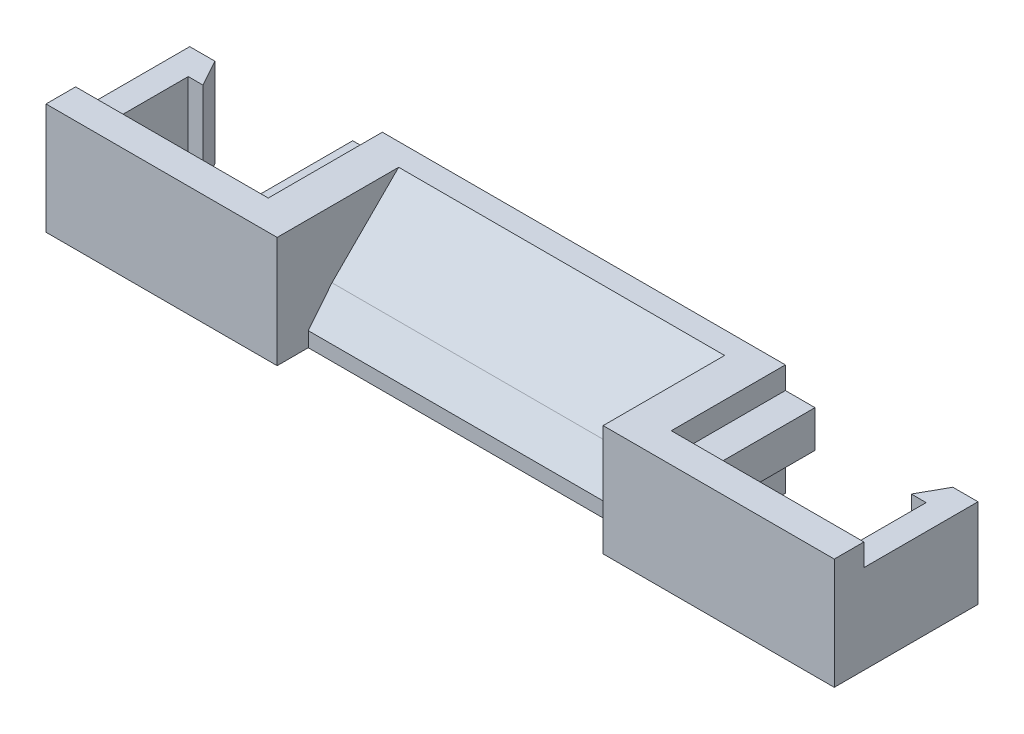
ISO-10303-21;
HEADER;
FILE_DESCRIPTION(('STEP AP214'),'2;1');
FILE_NAME('part.step','',(''),(''),'','','');
FILE_SCHEMA(('AUTOMOTIVE_DESIGN { 1 0 10303 214 1 1 1 1 }'));
ENDSEC;
DATA;
#1=APPLICATION_CONTEXT('core data for automotive mechanical design processes');
#2=APPLICATION_PROTOCOL_DEFINITION('international standard','automotive_design',2000,#1);
#3=PRODUCT_CONTEXT('',#1,'mechanical');
#4=PRODUCT('Part','Part','',(#3));
#5=PRODUCT_RELATED_PRODUCT_CATEGORY('part','',(#4));
#6=PRODUCT_DEFINITION_FORMATION('','',#4);
#7=PRODUCT_DEFINITION_CONTEXT('part definition',#1,'design');
#8=PRODUCT_DEFINITION('design','',#6,#7);
#9=PRODUCT_DEFINITION_SHAPE('','',#8);
#10=(LENGTH_UNIT() NAMED_UNIT(*) SI_UNIT(.MILLI.,.METRE.));
#11=(NAMED_UNIT(*) PLANE_ANGLE_UNIT() SI_UNIT($,.RADIAN.));
#12=(NAMED_UNIT(*) SI_UNIT($,.STERADIAN.) SOLID_ANGLE_UNIT());
#13=UNCERTAINTY_MEASURE_WITH_UNIT(LENGTH_MEASURE(1.E-05),#10,'distance_accuracy_value','');
#14=(GEOMETRIC_REPRESENTATION_CONTEXT(3) GLOBAL_UNCERTAINTY_ASSIGNED_CONTEXT((#13)) GLOBAL_UNIT_ASSIGNED_CONTEXT((#10,
#11,#12)) REPRESENTATION_CONTEXT('',''));
#15=CARTESIAN_POINT('',(0.,0.,0.));
#16=DIRECTION('',(0.,0.,1.));
#17=DIRECTION('',(1.,0.,0.));
#18=AXIS2_PLACEMENT_3D('',#15,#16,#17);
#19=CARTESIAN_POINT('',(-13.,0.,7.7));
#20=DIRECTION('',(0.,0.,1.));
#21=DIRECTION('',(1.,0.,0.));
#22=AXIS2_PLACEMENT_3D('',#19,#20,#21);
#23=PLANE('',#22);
#24=DIRECTION('',(0.,-1.,0.));
#25=VECTOR('',#24,1.);
#26=CARTESIAN_POINT('',(-11.3,6.,7.7));
#27=LINE('',#26,#25);
#28=CARTESIAN_POINT('',(-11.3,6.,7.7));
#29=VERTEX_POINT('',#28);
#30=CARTESIAN_POINT('',(-11.3,0.,7.7));
#31=VERTEX_POINT('',#30);
#32=EDGE_CURVE('E290',#29,#31,#27,.T.);
#33=ORIENTED_EDGE('',*,*,#32,.F.);
#34=DIRECTION('',(1.,0.,0.));
#35=VECTOR('',#34,1.);
#36=CARTESIAN_POINT('',(-11.3,6.,7.7));
#37=LINE('',#36,#35);
#38=CARTESIAN_POINT('',(-13.,6.,7.7));
#39=VERTEX_POINT('',#38);
#40=EDGE_CURVE('E286',#39,#29,#37,.T.);
#41=ORIENTED_EDGE('',*,*,#40,.F.);
#42=DIRECTION('',(0.,-1.,0.));
#43=VECTOR('',#42,1.);
#44=CARTESIAN_POINT('',(-13.,0.,7.7));
#45=LINE('',#44,#43);
#46=CARTESIAN_POINT('',(-13.,7.5,7.7));
#47=VERTEX_POINT('',#46);
#48=EDGE_CURVE('E334',#47,#39,#45,.T.);
#49=ORIENTED_EDGE('',*,*,#48,.F.);
#50=DIRECTION('',(1.,0.,0.));
#51=VECTOR('',#50,1.);
#52=CARTESIAN_POINT('',(-13.,7.5,7.7));
#53=LINE('',#52,#51);
#54=CARTESIAN_POINT('',(0.,7.5,7.7));
#55=VERTEX_POINT('',#54);
#56=EDGE_CURVE('E343',#47,#55,#53,.T.);
#57=ORIENTED_EDGE('',*,*,#56,.T.);
#58=DIRECTION('',(0.,-1.,0.));
#59=VECTOR('',#58,1.);
#60=CARTESIAN_POINT('',(0.,0.,7.7));
#61=LINE('',#60,#59);
#62=CARTESIAN_POINT('',(0.,6.,7.7));
#63=VERTEX_POINT('',#62);
#64=EDGE_CURVE('E332',#55,#63,#61,.T.);
#65=ORIENTED_EDGE('',*,*,#64,.T.);
#66=DIRECTION('',(-1.,0.,0.));
#67=VECTOR('',#66,1.);
#68=CARTESIAN_POINT('',(-2.,6.,7.7));
#69=LINE('',#68,#67);
#70=CARTESIAN_POINT('',(-2.,6.,7.7));
#71=VERTEX_POINT('',#70);
#72=EDGE_CURVE('E349',#63,#71,#69,.T.);
#73=ORIENTED_EDGE('',*,*,#72,.T.);
#74=DIRECTION('',(0.,-1.,0.));
#75=VECTOR('',#74,1.);
#76=CARTESIAN_POINT('',(-2.,0.,7.7));
#77=LINE('',#76,#75);
#78=CARTESIAN_POINT('',(-2.,3.5,7.7));
#79=VERTEX_POINT('',#78);
#80=EDGE_CURVE('E11',#71,#79,#77,.T.);
#81=ORIENTED_EDGE('',*,*,#80,.T.);
#82=DIRECTION('',(1.,0.,0.));
#83=VECTOR('',#82,1.);
#84=CARTESIAN_POINT('',(-2.,3.5,7.7));
#85=LINE('',#84,#83);
#86=CARTESIAN_POINT('',(0.,3.5,7.7));
#87=VERTEX_POINT('',#86);
#88=EDGE_CURVE('E346',#79,#87,#85,.T.);
#89=ORIENTED_EDGE('',*,*,#88,.T.);
#90=CARTESIAN_POINT('',(0.,0.,7.7));
#91=VERTEX_POINT('',#90);
#92=EDGE_CURVE('E316',#87,#91,#61,.T.);
#93=ORIENTED_EDGE('',*,*,#92,.T.);
#94=DIRECTION('',(1.,0.,0.));
#95=VECTOR('',#94,1.);
#96=CARTESIAN_POINT('',(-13.,0.,7.7));
#97=LINE('',#96,#95);
#98=EDGE_CURVE('E56',#31,#91,#97,.T.);
#99=ORIENTED_EDGE('',*,*,#98,.F.);
#100=EDGE_LOOP('',(#33,#41,#49,#57,#65,#73,#81,#89,#93,#99));
#101=FACE_BOUND('',#100,.T.);
#102=ADVANCED_FACE('F33',(#101),#23,.F.);
#103=CARTESIAN_POINT('',(40.2,7.5,7.7));
#104=DIRECTION('',(0.,0.,1.));
#105=DIRECTION('',(0.,-1.,0.));
#106=AXIS2_PLACEMENT_3D('',#103,#104,#105);
#107=PLANE('',#106);
#108=DIRECTION('',(0.,1.,0.));
#109=VECTOR('',#108,1.);
#110=CARTESIAN_POINT('',(38.5,6.,7.7));
#111=LINE('',#110,#109);
#112=CARTESIAN_POINT('',(38.5,0.,7.7));
#113=VERTEX_POINT('',#112);
#114=CARTESIAN_POINT('',(38.5,6.,7.7));
#115=VERTEX_POINT('',#114);
#116=EDGE_CURVE('E309',#113,#115,#111,.T.);
#117=ORIENTED_EDGE('',*,*,#116,.F.);
#118=DIRECTION('',(-1.,0.,0.));
#119=VECTOR('',#118,1.);
#120=CARTESIAN_POINT('',(40.2,0.,7.7));
#121=LINE('',#120,#119);
#122=CARTESIAN_POINT('',(27.2,0.,7.7));
#123=VERTEX_POINT('',#122);
#124=EDGE_CURVE('E364',#113,#123,#121,.T.);
#125=ORIENTED_EDGE('',*,*,#124,.T.);
#126=DIRECTION('',(0.,1.,0.));
#127=VECTOR('',#126,1.);
#128=CARTESIAN_POINT('',(27.2,7.5,7.7));
#129=LINE('',#128,#127);
#130=CARTESIAN_POINT('',(27.2,3.5,7.7));
#131=VERTEX_POINT('',#130);
#132=EDGE_CURVE('E356',#123,#131,#129,.T.);
#133=ORIENTED_EDGE('',*,*,#132,.T.);
#134=DIRECTION('',(1.,0.,0.));
#135=VECTOR('',#134,1.);
#136=CARTESIAN_POINT('',(29.2,3.5,7.7));
#137=LINE('',#136,#135);
#138=CARTESIAN_POINT('',(29.2,3.5,7.7));
#139=VERTEX_POINT('',#138);
#140=EDGE_CURVE('E374',#131,#139,#137,.T.);
#141=ORIENTED_EDGE('',*,*,#140,.T.);
#142=DIRECTION('',(0.,-1.,0.));
#143=VECTOR('',#142,1.);
#144=CARTESIAN_POINT('',(29.2,0.,7.7));
#145=LINE('',#144,#143);
#146=CARTESIAN_POINT('',(29.2,6.,7.7));
#147=VERTEX_POINT('',#146);
#148=EDGE_CURVE('E41',#147,#139,#145,.T.);
#149=ORIENTED_EDGE('',*,*,#148,.F.);
#150=DIRECTION('',(-1.,0.,0.));
#151=VECTOR('',#150,1.);
#152=CARTESIAN_POINT('',(29.2,6.,7.7));
#153=LINE('',#152,#151);
#154=CARTESIAN_POINT('',(27.2,6.,7.7));
#155=VERTEX_POINT('',#154);
#156=EDGE_CURVE('E371',#147,#155,#153,.T.);
#157=ORIENTED_EDGE('',*,*,#156,.T.);
#158=CARTESIAN_POINT('',(27.2,7.5,7.7));
#159=VERTEX_POINT('',#158);
#160=EDGE_CURVE('E352',#155,#159,#129,.T.);
#161=ORIENTED_EDGE('',*,*,#160,.T.);
#162=DIRECTION('',(-1.,0.,0.));
#163=VECTOR('',#162,1.);
#164=CARTESIAN_POINT('',(40.2,7.5,7.7));
#165=LINE('',#164,#163);
#166=CARTESIAN_POINT('',(40.2,7.5,7.7));
#167=VERTEX_POINT('',#166);
#168=EDGE_CURVE('E368',#167,#159,#165,.T.);
#169=ORIENTED_EDGE('',*,*,#168,.F.);
#170=DIRECTION('',(0.,1.,0.));
#171=VECTOR('',#170,1.);
#172=CARTESIAN_POINT('',(40.2,7.5,7.7));
#173=LINE('',#172,#171);
#174=CARTESIAN_POINT('',(40.2,6.,7.7));
#175=VERTEX_POINT('',#174);
#176=EDGE_CURVE('E353',#175,#167,#173,.T.);
#177=ORIENTED_EDGE('',*,*,#176,.F.);
#178=DIRECTION('',(1.,0.,0.));
#179=VECTOR('',#178,1.);
#180=CARTESIAN_POINT('',(40.2,6.,7.7));
#181=LINE('',#180,#179);
#182=EDGE_CURVE('E48',#115,#175,#181,.T.);
#183=ORIENTED_EDGE('',*,*,#182,.F.);
#184=EDGE_LOOP('',(#117,#125,#133,#141,#149,#157,#161,#169,#177,#183));
#185=FACE_BOUND('',#184,.T.);
#186=ADVANCED_FACE('F492',(#185),#107,.F.);
#187=CARTESIAN_POINT('',(0.,0.,9.7));
#188=DIRECTION('',(1.,0.,0.));
#189=DIRECTION('',(0.,0.,-1.));
#190=AXIS2_PLACEMENT_3D('',#187,#188,#189);
#191=PLANE('',#190);
#192=ORIENTED_EDGE('',*,*,#92,.F.);
#193=DIRECTION('',(0.,0.,1.));
#194=VECTOR('',#193,1.);
#195=CARTESIAN_POINT('',(0.,3.5,9.7));
#196=LINE('',#195,#194);
#197=CARTESIAN_POINT('',(0.,3.5,0.));
#198=VERTEX_POINT('',#197);
#199=EDGE_CURVE('E381',#198,#87,#196,.T.);
#200=ORIENTED_EDGE('',*,*,#199,.F.);
#201=DIRECTION('',(0.,-1.,0.));
#202=VECTOR('',#201,1.);
#203=CARTESIAN_POINT('',(0.,0.,0.));
#204=LINE('',#203,#202);
#205=CARTESIAN_POINT('',(0.,0.,0.));
#206=VERTEX_POINT('',#205);
#207=EDGE_CURVE('E444',#198,#206,#204,.T.);
#208=ORIENTED_EDGE('',*,*,#207,.T.);
#209=DIRECTION('',(0.,0.,-1.));
#210=VECTOR('',#209,1.);
#211=CARTESIAN_POINT('',(0.,0.,9.7));
#212=LINE('',#211,#210);
#213=EDGE_CURVE('E472',#91,#206,#212,.T.);
#214=ORIENTED_EDGE('',*,*,#213,.F.);
#215=EDGE_LOOP('',(#192,#200,#208,#214));
#216=FACE_BOUND('',#215,.T.);
#217=ADVANCED_FACE('F35',(#216),#191,.F.);
#218=ORIENTED_EDGE('',*,*,#64,.F.);
#219=DIRECTION('',(0.,0.,-1.));
#220=VECTOR('',#219,1.);
#221=CARTESIAN_POINT('',(0.,7.5,9.7));
#222=LINE('',#221,#220);
#223=CARTESIAN_POINT('',(0.,7.5,0.));
#224=VERTEX_POINT('',#223);
#225=EDGE_CURVE('E453',#55,#224,#222,.T.);
#226=ORIENTED_EDGE('',*,*,#225,.T.);
#227=CARTESIAN_POINT('',(0.,6.,0.));
#228=VERTEX_POINT('',#227);
#229=EDGE_CURVE('E454',#224,#228,#204,.T.);
#230=ORIENTED_EDGE('',*,*,#229,.T.);
#231=DIRECTION('',(0.,0.,-1.));
#232=VECTOR('',#231,1.);
#233=CARTESIAN_POINT('',(0.,6.,0.));
#234=LINE('',#233,#232);
#235=EDGE_CURVE('E377',#63,#228,#234,.T.);
#236=ORIENTED_EDGE('',*,*,#235,.F.);
#237=EDGE_LOOP('',(#218,#226,#230,#236));
#238=FACE_BOUND('',#237,.T.);
#239=ADVANCED_FACE('F582',(#238),#191,.F.);
#240=CARTESIAN_POINT('',(-2.,6.,0.));
#241=DIRECTION('',(0.,-1.,0.));
#242=DIRECTION('',(0.,0.,-1.));
#243=AXIS2_PLACEMENT_3D('',#240,#241,#242);
#244=PLANE('',#243);
#245=ORIENTED_EDGE('',*,*,#72,.F.);
#246=ORIENTED_EDGE('',*,*,#235,.T.);
#247=DIRECTION('',(1.,0.,0.));
#248=VECTOR('',#247,1.);
#249=CARTESIAN_POINT('',(-2.,6.,0.));
#250=LINE('',#249,#248);
#251=CARTESIAN_POINT('',(-2.,6.,0.));
#252=VERTEX_POINT('',#251);
#253=EDGE_CURVE('E391',#252,#228,#250,.T.);
#254=ORIENTED_EDGE('',*,*,#253,.F.);
#255=DIRECTION('',(0.,0.,-1.));
#256=VECTOR('',#255,1.);
#257=CARTESIAN_POINT('',(-2.,6.,0.));
#258=LINE('',#257,#256);
#259=EDGE_CURVE('E378',#71,#252,#258,.T.);
#260=ORIENTED_EDGE('',*,*,#259,.F.);
#261=EDGE_LOOP('',(#245,#246,#254,#260));
#262=FACE_BOUND('',#261,.T.);
#263=ADVANCED_FACE('F578',(#262),#244,.F.);
#264=CARTESIAN_POINT('',(-2.,3.5,9.7));
#265=DIRECTION('',(0.,1.,0.));
#266=DIRECTION('',(0.,0.,1.));
#267=AXIS2_PLACEMENT_3D('',#264,#265,#266);
#268=PLANE('',#267);
#269=ORIENTED_EDGE('',*,*,#88,.F.);
#270=DIRECTION('',(0.,0.,1.));
#271=VECTOR('',#270,1.);
#272=CARTESIAN_POINT('',(-2.,3.5,9.7));
#273=LINE('',#272,#271);
#274=CARTESIAN_POINT('',(-2.,3.5,0.));
#275=VERTEX_POINT('',#274);
#276=EDGE_CURVE('E383',#275,#79,#273,.T.);
#277=ORIENTED_EDGE('',*,*,#276,.F.);
#278=DIRECTION('',(1.,0.,0.));
#279=VECTOR('',#278,1.);
#280=CARTESIAN_POINT('',(-2.,3.5,0.));
#281=LINE('',#280,#279);
#282=EDGE_CURVE('E385',#275,#198,#281,.T.);
#283=ORIENTED_EDGE('',*,*,#282,.T.);
#284=ORIENTED_EDGE('',*,*,#199,.T.);
#285=EDGE_LOOP('',(#269,#277,#283,#284));
#286=FACE_BOUND('',#285,.T.);
#287=ADVANCED_FACE('F574',(#286),#268,.F.);
#288=CARTESIAN_POINT('',(-2.,0.,0.));
#289=DIRECTION('',(1.,0.,0.));
#290=DIRECTION('',(0.,0.,-1.));
#291=AXIS2_PLACEMENT_3D('',#288,#289,#290);
#292=PLANE('',#291);
#293=ORIENTED_EDGE('',*,*,#80,.F.);
#294=ORIENTED_EDGE('',*,*,#259,.T.);
#295=DIRECTION('',(0.,-1.,0.));
#296=VECTOR('',#295,1.);
#297=CARTESIAN_POINT('',(-2.,3.5,0.));
#298=LINE('',#297,#296);
#299=EDGE_CURVE('E380',#252,#275,#298,.T.);
#300=ORIENTED_EDGE('',*,*,#299,.T.);
#301=ORIENTED_EDGE('',*,*,#276,.T.);
#302=EDGE_LOOP('',(#293,#294,#300,#301));
#303=FACE_BOUND('',#302,.T.);
#304=ADVANCED_FACE('F570',(#303),#292,.F.);
#305=CARTESIAN_POINT('',(27.2,7.5,9.7));
#306=DIRECTION('',(-1.,0.,0.));
#307=DIRECTION('',(0.,0.,1.));
#308=AXIS2_PLACEMENT_3D('',#305,#306,#307);
#309=PLANE('',#308);
#310=ORIENTED_EDGE('',*,*,#160,.F.);
#311=DIRECTION('',(0.,0.,1.));
#312=VECTOR('',#311,1.);
#313=CARTESIAN_POINT('',(27.2,6.,9.7));
#314=LINE('',#313,#312);
#315=CARTESIAN_POINT('',(27.2,6.,0.));
#316=VERTEX_POINT('',#315);
#317=EDGE_CURVE('E398',#316,#155,#314,.T.);
#318=ORIENTED_EDGE('',*,*,#317,.F.);
#319=DIRECTION('',(0.,1.,0.));
#320=VECTOR('',#319,1.);
#321=CARTESIAN_POINT('',(27.2,7.5,0.));
#322=LINE('',#321,#320);
#323=CARTESIAN_POINT('',(27.2,7.5,0.));
#324=VERTEX_POINT('',#323);
#325=EDGE_CURVE('E460',#316,#324,#322,.T.);
#326=ORIENTED_EDGE('',*,*,#325,.T.);
#327=DIRECTION('',(0.,0.,-1.));
#328=VECTOR('',#327,1.);
#329=CARTESIAN_POINT('',(27.2,7.5,9.7));
#330=LINE('',#329,#328);
#331=EDGE_CURVE('E468',#159,#324,#330,.T.);
#332=ORIENTED_EDGE('',*,*,#331,.F.);
#333=EDGE_LOOP('',(#310,#318,#326,#332));
#334=FACE_BOUND('',#333,.T.);
#335=ADVANCED_FACE('F573',(#334),#309,.F.);
#336=ORIENTED_EDGE('',*,*,#132,.F.);
#337=DIRECTION('',(0.,0.,-1.));
#338=VECTOR('',#337,1.);
#339=CARTESIAN_POINT('',(27.2,0.,9.7));
#340=LINE('',#339,#338);
#341=CARTESIAN_POINT('',(27.2,0.,0.));
#342=VERTEX_POINT('',#341);
#343=EDGE_CURVE('E470',#123,#342,#340,.T.);
#344=ORIENTED_EDGE('',*,*,#343,.T.);
#345=CARTESIAN_POINT('',(27.2,3.5,0.));
#346=VERTEX_POINT('',#345);
#347=EDGE_CURVE('E461',#342,#346,#322,.T.);
#348=ORIENTED_EDGE('',*,*,#347,.T.);
#349=DIRECTION('',(0.,0.,-1.));
#350=VECTOR('',#349,1.);
#351=CARTESIAN_POINT('',(27.2,3.5,9.7));
#352=LINE('',#351,#350);
#353=EDGE_CURVE('E394',#131,#346,#352,.T.);
#354=ORIENTED_EDGE('',*,*,#353,.F.);
#355=EDGE_LOOP('',(#336,#344,#348,#354));
#356=FACE_BOUND('',#355,.T.);
#357=ADVANCED_FACE('F497',(#356),#309,.F.);
#358=CARTESIAN_POINT('',(29.2,3.5,9.7));
#359=DIRECTION('',(0.,1.,0.));
#360=DIRECTION('',(0.,0.,1.));
#361=AXIS2_PLACEMENT_3D('',#358,#359,#360);
#362=PLANE('',#361);
#363=ORIENTED_EDGE('',*,*,#140,.F.);
#364=ORIENTED_EDGE('',*,*,#353,.T.);
#365=DIRECTION('',(-1.,0.,0.));
#366=VECTOR('',#365,1.);
#367=CARTESIAN_POINT('',(29.2,3.5,0.));
#368=LINE('',#367,#366);
#369=CARTESIAN_POINT('',(29.2,3.5,0.));
#370=VERTEX_POINT('',#369);
#371=EDGE_CURVE('E409',#370,#346,#368,.T.);
#372=ORIENTED_EDGE('',*,*,#371,.F.);
#373=DIRECTION('',(0.,0.,-1.));
#374=VECTOR('',#373,1.);
#375=CARTESIAN_POINT('',(29.2,3.5,9.7));
#376=LINE('',#375,#374);
#377=EDGE_CURVE('E395',#139,#370,#376,.T.);
#378=ORIENTED_EDGE('',*,*,#377,.F.);
#379=EDGE_LOOP('',(#363,#364,#372,#378));
#380=FACE_BOUND('',#379,.T.);
#381=ADVANCED_FACE('F488',(#380),#362,.F.);
#382=CARTESIAN_POINT('',(29.2,6.,9.7));
#383=DIRECTION('',(0.,-1.,0.));
#384=DIRECTION('',(0.,0.,-1.));
#385=AXIS2_PLACEMENT_3D('',#382,#383,#384);
#386=PLANE('',#385);
#387=ORIENTED_EDGE('',*,*,#156,.F.);
#388=DIRECTION('',(0.,0.,1.));
#389=VECTOR('',#388,1.);
#390=CARTESIAN_POINT('',(29.2,6.,9.7));
#391=LINE('',#390,#389);
#392=CARTESIAN_POINT('',(29.2,6.,0.));
#393=VERTEX_POINT('',#392);
#394=EDGE_CURVE('E400',#393,#147,#391,.T.);
#395=ORIENTED_EDGE('',*,*,#394,.F.);
#396=DIRECTION('',(-1.,0.,0.));
#397=VECTOR('',#396,1.);
#398=CARTESIAN_POINT('',(29.2,6.,0.));
#399=LINE('',#398,#397);
#400=EDGE_CURVE('E403',#393,#316,#399,.T.);
#401=ORIENTED_EDGE('',*,*,#400,.T.);
#402=ORIENTED_EDGE('',*,*,#317,.T.);
#403=EDGE_LOOP('',(#387,#395,#401,#402));
#404=FACE_BOUND('',#403,.T.);
#405=ADVANCED_FACE('F513',(#404),#386,.F.);
#406=CARTESIAN_POINT('',(29.2,0.,0.));
#407=DIRECTION('',(1.,0.,0.));
#408=DIRECTION('',(0.,0.,-1.));
#409=AXIS2_PLACEMENT_3D('',#406,#407,#408);
#410=PLANE('',#409);
#411=ORIENTED_EDGE('',*,*,#394,.T.);
#412=ORIENTED_EDGE('',*,*,#148,.T.);
#413=ORIENTED_EDGE('',*,*,#377,.T.);
#414=DIRECTION('',(0.,1.,0.));
#415=VECTOR('',#414,1.);
#416=CARTESIAN_POINT('',(29.2,6.,0.));
#417=LINE('',#416,#415);
#418=EDGE_CURVE('E397',#370,#393,#417,.T.);
#419=ORIENTED_EDGE('',*,*,#418,.T.);
#420=EDGE_LOOP('',(#411,#412,#413,#419));
#421=FACE_BOUND('',#420,.T.);
#422=ADVANCED_FACE('F483',(#421),#410,.T.);
#423=CARTESIAN_POINT('',(0.,0.,9.7));
#424=DIRECTION('',(0.,0.,-1.));
#425=DIRECTION('',(-1.,0.,0.));
#426=AXIS2_PLACEMENT_3D('',#423,#424,#425);
#427=PLANE('',#426);
#428=DIRECTION('',(-1.,0.,0.));
#429=VECTOR('',#428,1.);
#430=CARTESIAN_POINT('',(0.,7.5,9.7));
#431=LINE('',#430,#429);
#432=CARTESIAN_POINT('',(2.6,7.5,9.7));
#433=VERTEX_POINT('',#432);
#434=CARTESIAN_POINT('',(-13.,7.5,9.7));
#435=VERTEX_POINT('',#434);
#436=EDGE_CURVE('E448',#433,#435,#431,.T.);
#437=ORIENTED_EDGE('',*,*,#436,.T.);
#438=DIRECTION('',(0.,1.,0.));
#439=VECTOR('',#438,1.);
#440=CARTESIAN_POINT('',(-13.,7.5,9.7));
#441=LINE('',#440,#439);
#442=CARTESIAN_POINT('',(-13.,0.,9.7));
#443=VERTEX_POINT('',#442);
#444=EDGE_CURVE('E328',#443,#435,#441,.T.);
#445=ORIENTED_EDGE('',*,*,#444,.F.);
#446=DIRECTION('',(1.,0.,0.));
#447=VECTOR('',#446,1.);
#448=CARTESIAN_POINT('',(0.,0.,9.7));
#449=LINE('',#448,#447);
#450=CARTESIAN_POINT('',(2.6,0.,9.7));
#451=VERTEX_POINT('',#450);
#452=EDGE_CURVE('E445',#443,#451,#449,.T.);
#453=ORIENTED_EDGE('',*,*,#452,.T.);
#454=DIRECTION('',(0.,-1.,0.));
#455=VECTOR('',#454,1.);
#456=CARTESIAN_POINT('',(2.6,0.,9.7));
#457=LINE('',#456,#455);
#458=EDGE_CURVE('E474',#433,#451,#457,.T.);
#459=ORIENTED_EDGE('',*,*,#458,.F.);
#460=EDGE_LOOP('',(#437,#445,#453,#459));
#461=FACE_BOUND('',#460,.T.);
#462=ADVANCED_FACE('F586',(#461),#427,.F.);
#463=CARTESIAN_POINT('',(0.,0.,9.7));
#464=DIRECTION('',(0.,1.,0.));
#465=DIRECTION('',(0.,0.,1.));
#466=AXIS2_PLACEMENT_3D('',#463,#464,#465);
#467=PLANE('',#466);
#468=CARTESIAN_POINT('',(24.6,0.,9.7));
#469=VERTEX_POINT('',#468);
#470=CARTESIAN_POINT('',(40.2,0.,9.7));
#471=VERTEX_POINT('',#470);
#472=EDGE_CURVE('E449',#469,#471,#449,.T.);
#473=ORIENTED_EDGE('',*,*,#472,.F.);
#474=DIRECTION('',(0.,0.,-1.));
#475=VECTOR('',#474,1.);
#476=CARTESIAN_POINT('',(24.6,0.,9.7));
#477=LINE('',#476,#475);
#478=CARTESIAN_POINT('',(24.6,0.,7.6));
#479=VERTEX_POINT('',#478);
#480=EDGE_CURVE('E441',#469,#479,#477,.T.);
#481=ORIENTED_EDGE('',*,*,#480,.T.);
#482=DIRECTION('',(1.,0.,0.));
#483=VECTOR('',#482,1.);
#484=CARTESIAN_POINT('',(0.,0.,7.6));
#485=LINE('',#484,#483);
#486=CARTESIAN_POINT('',(2.6,0.,7.6));
#487=VERTEX_POINT('',#486);
#488=EDGE_CURVE('E479',#487,#479,#485,.T.);
#489=ORIENTED_EDGE('',*,*,#488,.F.);
#490=DIRECTION('',(0.,0.,-1.));
#491=VECTOR('',#490,1.);
#492=CARTESIAN_POINT('',(2.6,0.,9.7));
#493=LINE('',#492,#491);
#494=EDGE_CURVE('E436',#451,#487,#493,.T.);
#495=ORIENTED_EDGE('',*,*,#494,.F.);
#496=ORIENTED_EDGE('',*,*,#452,.F.);
#497=DIRECTION('',(0.,0.,1.));
#498=VECTOR('',#497,1.);
#499=CARTESIAN_POINT('',(-13.,0.,9.7));
#500=LINE('',#499,#498);
#501=CARTESIAN_POINT('',(-13.,0.,0.));
#502=VERTEX_POINT('',#501);
#503=EDGE_CURVE('E337',#502,#443,#500,.T.);
#504=ORIENTED_EDGE('',*,*,#503,.F.);
#505=DIRECTION('',(-1.,0.,0.));
#506=VECTOR('',#505,1.);
#507=CARTESIAN_POINT('',(-11.3,0.,0.));
#508=LINE('',#507,#506);
#509=CARTESIAN_POINT('',(-11.3,0.,0.));
#510=VERTEX_POINT('',#509);
#511=EDGE_CURVE('E298',#510,#502,#508,.T.);
#512=ORIENTED_EDGE('',*,*,#511,.F.);
#513=DIRECTION('',(0.485642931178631,0.,0.874157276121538));
#514=VECTOR('',#513,1.);
#515=CARTESIAN_POINT('',(-10.3,0.,1.80000000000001));
#516=LINE('',#515,#514);
#517=CARTESIAN_POINT('',(-10.3,0.,1.80000000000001));
#518=VERTEX_POINT('',#517);
#519=EDGE_CURVE('E270',#510,#518,#516,.T.);
#520=ORIENTED_EDGE('',*,*,#519,.T.);
#521=DIRECTION('',(-1.,0.,0.));
#522=VECTOR('',#521,1.);
#523=CARTESIAN_POINT('',(-11.3,0.,1.8));
#524=LINE('',#523,#522);
#525=CARTESIAN_POINT('',(-11.3,0.,1.8));
#526=VERTEX_POINT('',#525);
#527=EDGE_CURVE('E249',#518,#526,#524,.T.);
#528=ORIENTED_EDGE('',*,*,#527,.T.);
#529=DIRECTION('',(0.,0.,1.));
#530=VECTOR('',#529,1.);
#531=CARTESIAN_POINT('',(-11.3,0.,-6.23618473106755));
#532=LINE('',#531,#530);
#533=EDGE_CURVE('E293',#526,#31,#532,.T.);
#534=ORIENTED_EDGE('',*,*,#533,.T.);
#535=ORIENTED_EDGE('',*,*,#98,.T.);
#536=ORIENTED_EDGE('',*,*,#213,.T.);
#537=DIRECTION('',(1.,0.,0.));
#538=VECTOR('',#537,1.);
#539=CARTESIAN_POINT('',(0.,0.,0.));
#540=LINE('',#539,#538);
#541=EDGE_CURVE('E457',#206,#342,#540,.T.);
#542=ORIENTED_EDGE('',*,*,#541,.T.);
#543=ORIENTED_EDGE('',*,*,#343,.F.);
#544=ORIENTED_EDGE('',*,*,#124,.F.);
#545=DIRECTION('',(0.,0.,1.));
#546=VECTOR('',#545,1.);
#547=CARTESIAN_POINT('',(38.5,0.,-6.23618473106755));
#548=LINE('',#547,#546);
#549=CARTESIAN_POINT('',(38.5,0.,1.8));
#550=VERTEX_POINT('',#549);
#551=EDGE_CURVE('E312',#550,#113,#548,.T.);
#552=ORIENTED_EDGE('',*,*,#551,.F.);
#553=DIRECTION('',(-1.,0.,0.));
#554=VECTOR('',#553,1.);
#555=CARTESIAN_POINT('',(38.5,0.,1.8));
#556=LINE('',#555,#554);
#557=CARTESIAN_POINT('',(37.5,0.,1.8));
#558=VERTEX_POINT('',#557);
#559=EDGE_CURVE('E275',#550,#558,#556,.T.);
#560=ORIENTED_EDGE('',*,*,#559,.T.);
#561=DIRECTION('',(0.485642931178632,0.,-0.874157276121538));
#562=VECTOR('',#561,1.);
#563=CARTESIAN_POINT('',(37.5,0.,1.8));
#564=LINE('',#563,#562);
#565=CARTESIAN_POINT('',(38.5,0.,0.));
#566=VERTEX_POINT('',#565);
#567=EDGE_CURVE('E273',#558,#566,#564,.T.);
#568=ORIENTED_EDGE('',*,*,#567,.T.);
#569=DIRECTION('',(-1.,0.,0.));
#570=VECTOR('',#569,1.);
#571=CARTESIAN_POINT('',(40.2,0.,0.));
#572=LINE('',#571,#570);
#573=CARTESIAN_POINT('',(40.2,0.,0.));
#574=VERTEX_POINT('',#573);
#575=EDGE_CURVE('E317',#574,#566,#572,.T.);
#576=ORIENTED_EDGE('',*,*,#575,.F.);
#577=DIRECTION('',(0.,0.,-1.));
#578=VECTOR('',#577,1.);
#579=CARTESIAN_POINT('',(40.2,0.,7.7));
#580=LINE('',#579,#578);
#581=EDGE_CURVE('E362',#471,#574,#580,.T.);
#582=ORIENTED_EDGE('',*,*,#581,.F.);
#583=EDGE_LOOP('',(#473,#481,#489,#495,#496,#504,#512,#520,#528,#534,#535,#536,#542,#543,#544,
#552,#560,#568,#576,#582));
#584=FACE_BOUND('',#583,.T.);
#585=ADVANCED_FACE('F499',(#584),#467,.F.);
#586=CARTESIAN_POINT('',(0.,7.5,9.7));
#587=DIRECTION('',(0.,-1.,0.));
#588=DIRECTION('',(0.,0.,-1.));
#589=AXIS2_PLACEMENT_3D('',#586,#587,#588);
#590=PLANE('',#589);
#591=DIRECTION('',(-1.,0.,0.));
#592=VECTOR('',#591,1.);
#593=CARTESIAN_POINT('',(24.6,7.5,1.5));
#594=LINE('',#593,#592);
#595=CARTESIAN_POINT('',(24.6,7.5,1.5));
#596=VERTEX_POINT('',#595);
#597=CARTESIAN_POINT('',(2.6,7.5,1.5));
#598=VERTEX_POINT('',#597);
#599=EDGE_CURVE('E421',#596,#598,#594,.T.);
#600=ORIENTED_EDGE('',*,*,#599,.F.);
#601=DIRECTION('',(0.,0.,1.));
#602=VECTOR('',#601,1.);
#603=CARTESIAN_POINT('',(24.6,7.5,9.7));
#604=LINE('',#603,#602);
#605=CARTESIAN_POINT('',(24.6,7.5,9.7));
#606=VERTEX_POINT('',#605);
#607=EDGE_CURVE('E438',#596,#606,#604,.T.);
#608=ORIENTED_EDGE('',*,*,#607,.T.);
#609=CARTESIAN_POINT('',(40.2,7.5,9.7));
#610=VERTEX_POINT('',#609);
#611=EDGE_CURVE('E450',#610,#606,#431,.T.);
#612=ORIENTED_EDGE('',*,*,#611,.F.);
#613=DIRECTION('',(0.,0.,1.));
#614=VECTOR('',#613,1.);
#615=CARTESIAN_POINT('',(40.2,7.5,7.7));
#616=LINE('',#615,#614);
#617=EDGE_CURVE('E355',#167,#610,#616,.T.);
#618=ORIENTED_EDGE('',*,*,#617,.F.);
#619=ORIENTED_EDGE('',*,*,#168,.T.);
#620=ORIENTED_EDGE('',*,*,#331,.T.);
#621=DIRECTION('',(-1.,0.,0.));
#622=VECTOR('',#621,1.);
#623=CARTESIAN_POINT('',(0.,7.5,0.));
#624=LINE('',#623,#622);
#625=EDGE_CURVE('E464',#324,#224,#624,.T.);
#626=ORIENTED_EDGE('',*,*,#625,.T.);
#627=ORIENTED_EDGE('',*,*,#225,.F.);
#628=ORIENTED_EDGE('',*,*,#56,.F.);
#629=DIRECTION('',(0.,0.,-1.));
#630=VECTOR('',#629,1.);
#631=CARTESIAN_POINT('',(-13.,7.5,7.7));
#632=LINE('',#631,#630);
#633=EDGE_CURVE('E331',#435,#47,#632,.T.);
#634=ORIENTED_EDGE('',*,*,#633,.F.);
#635=ORIENTED_EDGE('',*,*,#436,.F.);
#636=DIRECTION('',(0.,0.,1.));
#637=VECTOR('',#636,1.);
#638=CARTESIAN_POINT('',(2.6,7.5,9.7));
#639=LINE('',#638,#637);
#640=EDGE_CURVE('E434',#598,#433,#639,.T.);
#641=ORIENTED_EDGE('',*,*,#640,.F.);
#642=EDGE_LOOP('',(#600,#608,#612,#618,#619,#620,#626,#627,#628,#634,#635,#641));
#643=FACE_BOUND('',#642,.T.);
#644=ADVANCED_FACE('F521',(#643),#590,.F.);
#645=ORIENTED_EDGE('',*,*,#472,.T.);
#646=DIRECTION('',(0.,-1.,0.));
#647=VECTOR('',#646,1.);
#648=CARTESIAN_POINT('',(40.2,7.5,9.7));
#649=LINE('',#648,#647);
#650=EDGE_CURVE('E359',#610,#471,#649,.T.);
#651=ORIENTED_EDGE('',*,*,#650,.F.);
#652=ORIENTED_EDGE('',*,*,#611,.T.);
#653=DIRECTION('',(0.,-1.,0.));
#654=VECTOR('',#653,1.);
#655=CARTESIAN_POINT('',(24.6,0.,9.7));
#656=LINE('',#655,#654);
#657=EDGE_CURVE('E476',#606,#469,#656,.T.);
#658=ORIENTED_EDGE('',*,*,#657,.T.);
#659=EDGE_LOOP('',(#645,#651,#652,#658));
#660=FACE_BOUND('',#659,.T.);
#661=ADVANCED_FACE('F527',(#660),#427,.F.);
#662=CARTESIAN_POINT('',(0.,0.,0.));
#663=DIRECTION('',(0.,0.,-1.));
#664=DIRECTION('',(-1.,0.,0.));
#665=AXIS2_PLACEMENT_3D('',#662,#663,#664);
#666=PLANE('',#665);
#667=ORIENTED_EDGE('',*,*,#229,.F.);
#668=ORIENTED_EDGE('',*,*,#625,.F.);
#669=ORIENTED_EDGE('',*,*,#325,.F.);
#670=ORIENTED_EDGE('',*,*,#400,.F.);
#671=ORIENTED_EDGE('',*,*,#418,.F.);
#672=ORIENTED_EDGE('',*,*,#371,.T.);
#673=ORIENTED_EDGE('',*,*,#347,.F.);
#674=ORIENTED_EDGE('',*,*,#541,.F.);
#675=ORIENTED_EDGE('',*,*,#207,.F.);
#676=ORIENTED_EDGE('',*,*,#282,.F.);
#677=ORIENTED_EDGE('',*,*,#299,.F.);
#678=ORIENTED_EDGE('',*,*,#253,.T.);
#679=EDGE_LOOP('',(#667,#668,#669,#670,#671,#672,#673,#674,#675,#676,#677,#678));
#680=FACE_BOUND('',#679,.T.);
#681=ADVANCED_FACE('F507',(#680),#666,.T.);
#682=CARTESIAN_POINT('',(24.6,0.,7.6));
#683=DIRECTION('',(0.,0.,1.));
#684=DIRECTION('',(1.,0.,0.));
#685=AXIS2_PLACEMENT_3D('',#682,#683,#684);
#686=PLANE('',#685);
#687=ORIENTED_EDGE('',*,*,#488,.T.);
#688=DIRECTION('',(0.,1.,0.));
#689=VECTOR('',#688,1.);
#690=CARTESIAN_POINT('',(24.6,-0.801733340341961,7.6));
#691=LINE('',#690,#689);
#692=CARTESIAN_POINT('',(24.6,1.,7.6));
#693=VERTEX_POINT('',#692);
#694=EDGE_CURVE('E413',#479,#693,#691,.T.);
#695=ORIENTED_EDGE('',*,*,#694,.T.);
#696=DIRECTION('',(-1.,0.,0.));
#697=VECTOR('',#696,1.);
#698=CARTESIAN_POINT('',(24.6,1.,7.6));
#699=LINE('',#698,#697);
#700=CARTESIAN_POINT('',(2.6,1.,7.6));
#701=VERTEX_POINT('',#700);
#702=EDGE_CURVE('E431',#693,#701,#699,.T.);
#703=ORIENTED_EDGE('',*,*,#702,.T.);
#704=DIRECTION('',(0.,1.,0.));
#705=VECTOR('',#704,1.);
#706=CARTESIAN_POINT('',(2.6,0.,7.6));
#707=LINE('',#706,#705);
#708=EDGE_CURVE('E412',#487,#701,#707,.T.);
#709=ORIENTED_EDGE('',*,*,#708,.F.);
#710=EDGE_LOOP('',(#687,#695,#703,#709));
#711=FACE_BOUND('',#710,.T.);
#712=ADVANCED_FACE('F595',(#711),#686,.T.);
#713=CARTESIAN_POINT('',(24.6,0.,0.));
#714=DIRECTION('',(1.,0.,0.));
#715=DIRECTION('',(0.,0.,-1.));
#716=AXIS2_PLACEMENT_3D('',#713,#714,#715);
#717=PLANE('',#716);
#718=ORIENTED_EDGE('',*,*,#657,.F.);
#719=ORIENTED_EDGE('',*,*,#607,.F.);
#720=DIRECTION('',(0.,0.707106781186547,-0.707106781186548));
#721=VECTOR('',#720,1.);
#722=CARTESIAN_POINT('',(24.6,3.,6.));
#723=LINE('',#722,#721);
#724=CARTESIAN_POINT('',(24.6,3.,6.));
#725=VERTEX_POINT('',#724);
#726=EDGE_CURVE('E418',#725,#596,#723,.T.);
#727=ORIENTED_EDGE('',*,*,#726,.F.);
#728=DIRECTION('',(0.,0.78086880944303,-0.624695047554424));
#729=VECTOR('',#728,1.);
#730=CARTESIAN_POINT('',(24.6,1.,7.6));
#731=LINE('',#730,#729);
#732=EDGE_CURVE('E415',#693,#725,#731,.T.);
#733=ORIENTED_EDGE('',*,*,#732,.F.);
#734=ORIENTED_EDGE('',*,*,#694,.F.);
#735=ORIENTED_EDGE('',*,*,#480,.F.);
#736=EDGE_LOOP('',(#718,#719,#727,#733,#734,#735));
#737=FACE_BOUND('',#736,.T.);
#738=ADVANCED_FACE('F591',(#737),#717,.F.);
#739=CARTESIAN_POINT('',(2.6,0.,0.));
#740=DIRECTION('',(1.,0.,0.));
#741=DIRECTION('',(0.,0.,-1.));
#742=AXIS2_PLACEMENT_3D('',#739,#740,#741);
#743=PLANE('',#742);
#744=ORIENTED_EDGE('',*,*,#494,.T.);
#745=ORIENTED_EDGE('',*,*,#708,.T.);
#746=DIRECTION('',(0.,0.78086880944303,-0.624695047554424));
#747=VECTOR('',#746,1.);
#748=CARTESIAN_POINT('',(2.6,1.,7.6));
#749=LINE('',#748,#747);
#750=CARTESIAN_POINT('',(2.6,3.,6.));
#751=VERTEX_POINT('',#750);
#752=EDGE_CURVE('E423',#701,#751,#749,.T.);
#753=ORIENTED_EDGE('',*,*,#752,.T.);
#754=DIRECTION('',(0.,0.707106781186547,-0.707106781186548));
#755=VECTOR('',#754,1.);
#756=CARTESIAN_POINT('',(2.6,3.,6.));
#757=LINE('',#756,#755);
#758=EDGE_CURVE('E416',#751,#598,#757,.T.);
#759=ORIENTED_EDGE('',*,*,#758,.T.);
#760=ORIENTED_EDGE('',*,*,#640,.T.);
#761=ORIENTED_EDGE('',*,*,#458,.T.);
#762=EDGE_LOOP('',(#744,#745,#753,#759,#760,#761));
#763=FACE_BOUND('',#762,.T.);
#764=ADVANCED_FACE('F594',(#763),#743,.T.);
#765=CARTESIAN_POINT('',(24.6,1.,7.6));
#766=DIRECTION('',(0.,0.624695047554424,0.78086880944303));
#767=DIRECTION('',(0.,-0.78086880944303,0.624695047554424));
#768=AXIS2_PLACEMENT_3D('',#765,#766,#767);
#769=PLANE('',#768);
#770=ORIENTED_EDGE('',*,*,#752,.F.);
#771=ORIENTED_EDGE('',*,*,#702,.F.);
#772=ORIENTED_EDGE('',*,*,#732,.T.);
#773=DIRECTION('',(-1.,0.,0.));
#774=VECTOR('',#773,1.);
#775=CARTESIAN_POINT('',(24.6,3.,6.));
#776=LINE('',#775,#774);
#777=EDGE_CURVE('E428',#725,#751,#776,.T.);
#778=ORIENTED_EDGE('',*,*,#777,.T.);
#779=EDGE_LOOP('',(#770,#771,#772,#778));
#780=FACE_BOUND('',#779,.T.);
#781=ADVANCED_FACE('F599',(#780),#769,.T.);
#782=CARTESIAN_POINT('',(24.6,3.,6.));
#783=DIRECTION('',(0.,0.707106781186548,0.707106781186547));
#784=DIRECTION('',(0.,-0.707106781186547,0.707106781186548));
#785=AXIS2_PLACEMENT_3D('',#782,#783,#784);
#786=PLANE('',#785);
#787=ORIENTED_EDGE('',*,*,#758,.F.);
#788=ORIENTED_EDGE('',*,*,#777,.F.);
#789=ORIENTED_EDGE('',*,*,#726,.T.);
#790=ORIENTED_EDGE('',*,*,#599,.T.);
#791=EDGE_LOOP('',(#787,#788,#789,#790));
#792=FACE_BOUND('',#791,.T.);
#793=ADVANCED_FACE('F568',(#792),#786,.T.);
#794=CARTESIAN_POINT('',(40.2,0.,0.));
#795=DIRECTION('',(-1.,0.,0.));
#796=DIRECTION('',(0.,0.,1.));
#797=AXIS2_PLACEMENT_3D('',#794,#795,#796);
#798=PLANE('',#797);
#799=ORIENTED_EDGE('',*,*,#581,.T.);
#800=DIRECTION('',(0.,-1.,0.));
#801=VECTOR('',#800,1.);
#802=CARTESIAN_POINT('',(40.2,6.,0.));
#803=LINE('',#802,#801);
#804=CARTESIAN_POINT('',(40.2,6.,0.));
#805=VERTEX_POINT('',#804);
#806=EDGE_CURVE('E320',#805,#574,#803,.T.);
#807=ORIENTED_EDGE('',*,*,#806,.F.);
#808=DIRECTION('',(0.,0.,1.));
#809=VECTOR('',#808,1.);
#810=CARTESIAN_POINT('',(40.2,6.,-6.23618473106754));
#811=LINE('',#810,#809);
#812=EDGE_CURVE('E297',#805,#175,#811,.T.);
#813=ORIENTED_EDGE('',*,*,#812,.T.);
#814=ORIENTED_EDGE('',*,*,#176,.T.);
#815=ORIENTED_EDGE('',*,*,#617,.T.);
#816=ORIENTED_EDGE('',*,*,#650,.T.);
#817=EDGE_LOOP('',(#799,#807,#813,#814,#815,#816));
#818=FACE_BOUND('',#817,.T.);
#819=ADVANCED_FACE('F524',(#818),#798,.F.);
#820=CARTESIAN_POINT('',(-13.,0.,0.));
#821=DIRECTION('',(1.,0.,0.));
#822=DIRECTION('',(0.,0.,-1.));
#823=AXIS2_PLACEMENT_3D('',#820,#821,#822);
#824=PLANE('',#823);
#825=ORIENTED_EDGE('',*,*,#444,.T.);
#826=ORIENTED_EDGE('',*,*,#633,.T.);
#827=ORIENTED_EDGE('',*,*,#48,.T.);
#828=DIRECTION('',(0.,0.,1.));
#829=VECTOR('',#828,1.);
#830=CARTESIAN_POINT('',(-13.,6.,-6.23618473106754));
#831=LINE('',#830,#829);
#832=CARTESIAN_POINT('',(-13.,6.,0.));
#833=VERTEX_POINT('',#832);
#834=EDGE_CURVE('E289',#833,#39,#831,.T.);
#835=ORIENTED_EDGE('',*,*,#834,.F.);
#836=DIRECTION('',(0.,1.,0.));
#837=VECTOR('',#836,1.);
#838=CARTESIAN_POINT('',(-13.,6.,0.));
#839=LINE('',#838,#837);
#840=EDGE_CURVE('E294',#502,#833,#839,.T.);
#841=ORIENTED_EDGE('',*,*,#840,.F.);
#842=ORIENTED_EDGE('',*,*,#503,.T.);
#843=EDGE_LOOP('',(#825,#826,#827,#835,#841,#842));
#844=FACE_BOUND('',#843,.T.);
#845=ADVANCED_FACE('F548',(#844),#824,.F.);
#846=CARTESIAN_POINT('',(38.5,6.,-6.23618473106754));
#847=DIRECTION('',(1.,0.,0.));
#848=DIRECTION('',(0.,0.,-1.));
#849=AXIS2_PLACEMENT_3D('',#846,#847,#848);
#850=PLANE('',#849);
#851=DIRECTION('',(0.,0.,1.));
#852=VECTOR('',#851,1.);
#853=CARTESIAN_POINT('',(38.5,6.,-6.23618473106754));
#854=LINE('',#853,#852);
#855=CARTESIAN_POINT('',(38.5,6.,1.8));
#856=VERTEX_POINT('',#855);
#857=EDGE_CURVE('E308',#856,#115,#854,.T.);
#858=ORIENTED_EDGE('',*,*,#857,.F.);
#859=DIRECTION('',(0.,1.,0.));
#860=VECTOR('',#859,1.);
#861=CARTESIAN_POINT('',(38.5,-2.05912602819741,1.8));
#862=LINE('',#861,#860);
#863=EDGE_CURVE('E276',#550,#856,#862,.T.);
#864=ORIENTED_EDGE('',*,*,#863,.F.);
#865=ORIENTED_EDGE('',*,*,#551,.T.);
#866=ORIENTED_EDGE('',*,*,#116,.T.);
#867=EDGE_LOOP('',(#858,#864,#865,#866));
#868=FACE_BOUND('',#867,.T.);
#869=ADVANCED_FACE('F546',(#868),#850,.F.);
#870=CARTESIAN_POINT('',(40.2,6.,-6.23618473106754));
#871=DIRECTION('',(0.,-1.,0.));
#872=DIRECTION('',(0.,0.,-1.));
#873=AXIS2_PLACEMENT_3D('',#870,#871,#872);
#874=PLANE('',#873);
#875=DIRECTION('',(1.,0.,0.));
#876=VECTOR('',#875,1.);
#877=CARTESIAN_POINT('',(40.2,6.,0.));
#878=LINE('',#877,#876);
#879=CARTESIAN_POINT('',(38.5,6.,0.));
#880=VERTEX_POINT('',#879);
#881=EDGE_CURVE('E307',#880,#805,#878,.T.);
#882=ORIENTED_EDGE('',*,*,#881,.F.);
#883=DIRECTION('',(-0.485642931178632,0.,0.874157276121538));
#884=VECTOR('',#883,1.);
#885=CARTESIAN_POINT('',(37.5,6.,1.8));
#886=LINE('',#885,#884);
#887=CARTESIAN_POINT('',(37.5,6.,1.8));
#888=VERTEX_POINT('',#887);
#889=EDGE_CURVE('E272',#880,#888,#886,.T.);
#890=ORIENTED_EDGE('',*,*,#889,.T.);
#891=DIRECTION('',(1.,0.,0.));
#892=VECTOR('',#891,1.);
#893=CARTESIAN_POINT('',(38.5,6.,1.8));
#894=LINE('',#893,#892);
#895=EDGE_CURVE('E279',#888,#856,#894,.T.);
#896=ORIENTED_EDGE('',*,*,#895,.T.);
#897=ORIENTED_EDGE('',*,*,#857,.T.);
#898=ORIENTED_EDGE('',*,*,#182,.T.);
#899=ORIENTED_EDGE('',*,*,#812,.F.);
#900=EDGE_LOOP('',(#882,#890,#896,#897,#898,#899));
#901=FACE_BOUND('',#900,.T.);
#902=ADVANCED_FACE('F535',(#901),#874,.F.);
#903=CARTESIAN_POINT('',(0.,0.,0.));
#904=DIRECTION('',(0.,0.,-1.));
#905=DIRECTION('',(-1.,0.,0.));
#906=AXIS2_PLACEMENT_3D('',#903,#904,#905);
#907=PLANE('',#906);
#908=ORIENTED_EDGE('',*,*,#881,.T.);
#909=ORIENTED_EDGE('',*,*,#806,.T.);
#910=ORIENTED_EDGE('',*,*,#575,.T.);
#911=DIRECTION('',(0.,1.,0.));
#912=VECTOR('',#911,1.);
#913=CARTESIAN_POINT('',(38.5,6.,0.));
#914=LINE('',#913,#912);
#915=EDGE_CURVE('E313',#566,#880,#914,.T.);
#916=ORIENTED_EDGE('',*,*,#915,.T.);
#917=EDGE_LOOP('',(#908,#909,#910,#916));
#918=FACE_BOUND('',#917,.T.);
#919=ADVANCED_FACE('F533',(#918),#907,.T.);
#920=CARTESIAN_POINT('',(-11.3,6.,-6.23618473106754));
#921=DIRECTION('',(-1.,0.,0.));
#922=DIRECTION('',(0.,0.,1.));
#923=AXIS2_PLACEMENT_3D('',#920,#921,#922);
#924=PLANE('',#923);
#925=ORIENTED_EDGE('',*,*,#533,.F.);
#926=DIRECTION('',(0.,1.,0.));
#927=VECTOR('',#926,1.);
#928=CARTESIAN_POINT('',(-11.3,-2.05912602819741,1.8));
#929=LINE('',#928,#927);
#930=CARTESIAN_POINT('',(-11.3,6.,1.8));
#931=VERTEX_POINT('',#930);
#932=EDGE_CURVE('E251',#526,#931,#929,.T.);
#933=ORIENTED_EDGE('',*,*,#932,.T.);
#934=DIRECTION('',(0.,0.,1.));
#935=VECTOR('',#934,1.);
#936=CARTESIAN_POINT('',(-11.3,6.,-6.23618473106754));
#937=LINE('',#936,#935);
#938=EDGE_CURVE('E265',#931,#29,#937,.T.);
#939=ORIENTED_EDGE('',*,*,#938,.T.);
#940=ORIENTED_EDGE('',*,*,#32,.T.);
#941=EDGE_LOOP('',(#925,#933,#939,#940));
#942=FACE_BOUND('',#941,.T.);
#943=ADVANCED_FACE('F649',(#942),#924,.F.);
#944=CARTESIAN_POINT('',(-11.3,6.,-6.23618473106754));
#945=DIRECTION('',(0.,-1.,0.));
#946=DIRECTION('',(0.,0.,-1.));
#947=AXIS2_PLACEMENT_3D('',#944,#945,#946);
#948=PLANE('',#947);
#949=DIRECTION('',(1.,0.,0.));
#950=VECTOR('',#949,1.);
#951=CARTESIAN_POINT('',(-11.3,6.,0.));
#952=LINE('',#951,#950);
#953=CARTESIAN_POINT('',(-11.3,6.,0.));
#954=VERTEX_POINT('',#953);
#955=EDGE_CURVE('E288',#833,#954,#952,.T.);
#956=ORIENTED_EDGE('',*,*,#955,.F.);
#957=ORIENTED_EDGE('',*,*,#834,.T.);
#958=ORIENTED_EDGE('',*,*,#40,.T.);
#959=ORIENTED_EDGE('',*,*,#938,.F.);
#960=DIRECTION('',(1.,0.,0.));
#961=VECTOR('',#960,1.);
#962=CARTESIAN_POINT('',(-11.3,6.,1.8));
#963=LINE('',#962,#961);
#964=CARTESIAN_POINT('',(-10.3,6.,1.80000000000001));
#965=VERTEX_POINT('',#964);
#966=EDGE_CURVE('E247',#931,#965,#963,.T.);
#967=ORIENTED_EDGE('',*,*,#966,.T.);
#968=DIRECTION('',(-0.485642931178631,0.,-0.874157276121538));
#969=VECTOR('',#968,1.);
#970=CARTESIAN_POINT('',(-10.3,6.,1.80000000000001));
#971=LINE('',#970,#969);
#972=EDGE_CURVE('E252',#965,#954,#971,.T.);
#973=ORIENTED_EDGE('',*,*,#972,.T.);
#974=EDGE_LOOP('',(#956,#957,#958,#959,#967,#973));
#975=FACE_BOUND('',#974,.T.);
#976=ADVANCED_FACE('F263',(#975),#948,.F.);
#977=CARTESIAN_POINT('',(0.,0.,0.));
#978=DIRECTION('',(0.,0.,-1.));
#979=DIRECTION('',(-1.,0.,0.));
#980=AXIS2_PLACEMENT_3D('',#977,#978,#979);
#981=PLANE('',#980);
#982=ORIENTED_EDGE('',*,*,#955,.T.);
#983=DIRECTION('',(0.,-1.,0.));
#984=VECTOR('',#983,1.);
#985=CARTESIAN_POINT('',(-11.3,6.,0.));
#986=LINE('',#985,#984);
#987=EDGE_CURVE('E257',#954,#510,#986,.T.);
#988=ORIENTED_EDGE('',*,*,#987,.T.);
#989=ORIENTED_EDGE('',*,*,#511,.T.);
#990=ORIENTED_EDGE('',*,*,#840,.T.);
#991=EDGE_LOOP('',(#982,#988,#989,#990));
#992=FACE_BOUND('',#991,.T.);
#993=ADVANCED_FACE('F644',(#992),#981,.T.);
#994=CARTESIAN_POINT('',(37.5,-2.05912602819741,1.8));
#995=DIRECTION('',(-0.874157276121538,0.,-0.485642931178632));
#996=DIRECTION('',(-0.485642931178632,0.,0.874157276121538));
#997=AXIS2_PLACEMENT_3D('',#994,#995,#996);
#998=PLANE('',#997);
#999=ORIENTED_EDGE('',*,*,#567,.F.);
#1000=DIRECTION('',(0.,1.,0.));
#1001=VECTOR('',#1000,1.);
#1002=CARTESIAN_POINT('',(37.5,-2.05912602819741,1.8));
#1003=LINE('',#1002,#1001);
#1004=EDGE_CURVE('E282',#558,#888,#1003,.T.);
#1005=ORIENTED_EDGE('',*,*,#1004,.T.);
#1006=ORIENTED_EDGE('',*,*,#889,.F.);
#1007=ORIENTED_EDGE('',*,*,#915,.F.);
#1008=EDGE_LOOP('',(#999,#1005,#1006,#1007));
#1009=FACE_BOUND('',#1008,.T.);
#1010=ADVANCED_FACE('F540',(#1009),#998,.T.);
#1011=CARTESIAN_POINT('',(38.5,-2.05912602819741,1.8));
#1012=DIRECTION('',(0.,0.,1.));
#1013=DIRECTION('',(1.,0.,0.));
#1014=AXIS2_PLACEMENT_3D('',#1011,#1012,#1013);
#1015=PLANE('',#1014);
#1016=ORIENTED_EDGE('',*,*,#559,.F.);
#1017=ORIENTED_EDGE('',*,*,#863,.T.);
#1018=ORIENTED_EDGE('',*,*,#895,.F.);
#1019=ORIENTED_EDGE('',*,*,#1004,.F.);
#1020=EDGE_LOOP('',(#1016,#1017,#1018,#1019));
#1021=FACE_BOUND('',#1020,.T.);
#1022=ADVANCED_FACE('F543',(#1021),#1015,.T.);
#1023=CARTESIAN_POINT('',(-11.3,-2.05912602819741,1.8));
#1024=DIRECTION('',(0.,0.,1.));
#1025=DIRECTION('',(1.,0.,0.));
#1026=AXIS2_PLACEMENT_3D('',#1023,#1024,#1025);
#1027=PLANE('',#1026);
#1028=ORIENTED_EDGE('',*,*,#527,.F.);
#1029=DIRECTION('',(0.,1.,0.));
#1030=VECTOR('',#1029,1.);
#1031=CARTESIAN_POINT('',(-10.3,-2.05912602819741,1.80000000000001));
#1032=LINE('',#1031,#1030);
#1033=EDGE_CURVE('E242',#518,#965,#1032,.T.);
#1034=ORIENTED_EDGE('',*,*,#1033,.T.);
#1035=ORIENTED_EDGE('',*,*,#966,.F.);
#1036=ORIENTED_EDGE('',*,*,#932,.F.);
#1037=EDGE_LOOP('',(#1028,#1034,#1035,#1036));
#1038=FACE_BOUND('',#1037,.T.);
#1039=ADVANCED_FACE('F244',(#1038),#1027,.T.);
#1040=CARTESIAN_POINT('',(-10.3,-2.05912602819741,1.80000000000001));
#1041=DIRECTION('',(0.874157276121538,0.,-0.485642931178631));
#1042=DIRECTION('',(-0.485642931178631,0.,-0.874157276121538));
#1043=AXIS2_PLACEMENT_3D('',#1040,#1041,#1042);
#1044=PLANE('',#1043);
#1045=ORIENTED_EDGE('',*,*,#519,.F.);
#1046=ORIENTED_EDGE('',*,*,#987,.F.);
#1047=ORIENTED_EDGE('',*,*,#972,.F.);
#1048=ORIENTED_EDGE('',*,*,#1033,.F.);
#1049=EDGE_LOOP('',(#1045,#1046,#1047,#1048));
#1050=FACE_BOUND('',#1049,.T.);
#1051=ADVANCED_FACE('F255',(#1050),#1044,.T.);
#1052=CLOSED_SHELL('',(#102,#186,#217,#239,#263,#287,#304,#335,#357,#381,#405,#422,#462,#585,
#644,#661,#681,#712,#738,#764,#781,#793,#819,#845,#869,#902,#919,#943,#976,#993,#1010,#1022,
#1039,#1051));
#1053=MANIFOLD_SOLID_BREP('B2',#1052);
#1054=ADVANCED_BREP_SHAPE_REPRESENTATION('',(#18,#1053),#14);
#1055=SHAPE_DEFINITION_REPRESENTATION(#9,#1054);
ENDSEC;
END-ISO-10303-21;
